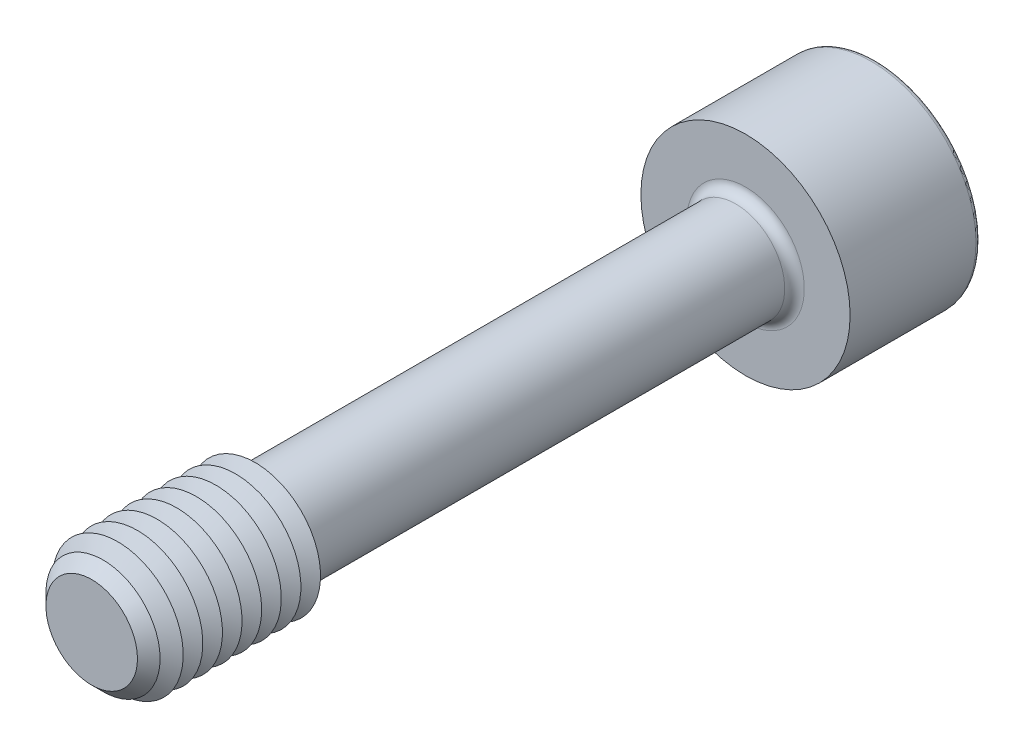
from build123d import *

# Parameters (mm, degrees)
SKETCH1_R       = 3.75
EXTRUDE1_DEPTH  = 25
CHAMFER1_SIZE   = 1.5
SKETCH3_R       = 8
EXTRUDE2_DEPTH  = 10
EXTRUDE3_DEPTH  = 8
FILLET1_R       = 0.75
FILLET2_R       = 0.375
LPATTERN1_COUNT = 8
LPATTERN1_PITCH = 1.5


with BuildPart() as part:
    # Sketch1 → Extrude1 (new, symmetric)
    with BuildSketch(Plane.XY):
        Circle(SKETCH1_R)
    extrude(amount=EXTRUDE1_DEPTH, both=True)

    # Sketch2 → Revolve1 (revolve)
    with BuildSketch(Plane(origin=(0, 0, 0), x_dir=(0, 0, -1), z_dir=(1, 0, 0))):
        Polygon((-25, 0), (-25, 5), (-12.5, 5), (-11.778312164, 3.75), (-11.778312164, 0), align=None)
    revolve(axis=Axis((0, 0, 11.778312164), (0, 0, 1)))

    # Chamfer1
    chamfer1_edges = [part.edges().sort_by_distance(p)[0] for p in [
        (0, -5, 25),
    ]]
    chamfer(chamfer1_edges, length=CHAMFER1_SIZE)

    # Sketch3 → Extrude2 (add)
    with BuildSketch(Plane(origin=(0, 0, -25), x_dir=(-1, 0, 0), z_dir=(0, 0, -1))):
        Circle(SKETCH3_R)
    extrude(amount=EXTRUDE2_DEPTH)

    # Sketch4 → Extrude3 (cut)
    with BuildSketch(Plane(origin=(-13.7, 0, -35), x_dir=(1, 0, 0), z_dir=(0, 0, 1))):
        Polygon((11.390598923, -4), (16.009401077, -4), (18.318802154, 0), (16.009401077, 4), (11.390598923, 4), (9.081197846, 0), align=None)
    extrude(amount=EXTRUDE3_DEPTH, mode=Mode.SUBTRACT)

    # Fillet1
    fillet1_edges = [part.edges().sort_by_distance(p)[0] for p in [
        (-3.75, 0, -25),
    ]]
    fillet(fillet1_edges, radius=FILLET1_R)

    # Fillet2
    fillet2_edges = [part.edges().sort_by_distance(p)[0] for p in [
        (8, 0, -35),
    ]]
    fillet(fillet2_edges, radius=FILLET2_R)

    # Sketch5 → Cut-Revolve1 (revolve, cut)
    with BuildSketch(Plane(origin=(0, 0, 0), x_dir=(0, 0, -1), z_dir=(1, 0, 0)), mode=Mode.PRIVATE) as cut_revolve1_sk:
        Polygon((27, 0), (27, -4), (24.690598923, 0), align=None)
    revolve(cut_revolve1_sk.sketch.rotate(Axis((0, 0, -24.690598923), (0, 0, -1)), 90), axis=Axis((0, 0, -24.690598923), (0, 0, -1)), mode=Mode.SUBTRACT)

    # Sketch7 → Cut-Revolve2 (revolve, cut)
    with BuildSketch(Plane(origin=(0, 0, 0), x_dir=(0, 0, -1), z_dir=(1, 0, 0)), mode=Mode.PRIVATE) as cut_revolve2_sk:
        Polygon((-12.5, 5), (-13.25, 3.700961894), (-14, 5), align=None)
    cut_revolve2 = revolve(cut_revolve2_sk.sketch.rotate(Axis((0, 0, -1.332048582), (0, 0, 1)), 90), axis=Axis((0, 0, -1.332048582), (0, 0, 1)), mode=Mode.SUBTRACT)

    # LPattern1: Cut-Revolve2 ×8
    with Locations(*[(0, 0, i * LPATTERN1_PITCH) for i in range(1, LPATTERN1_COUNT)]):
        add(cut_revolve2, mode=Mode.SUBTRACT)


solid = part.part
